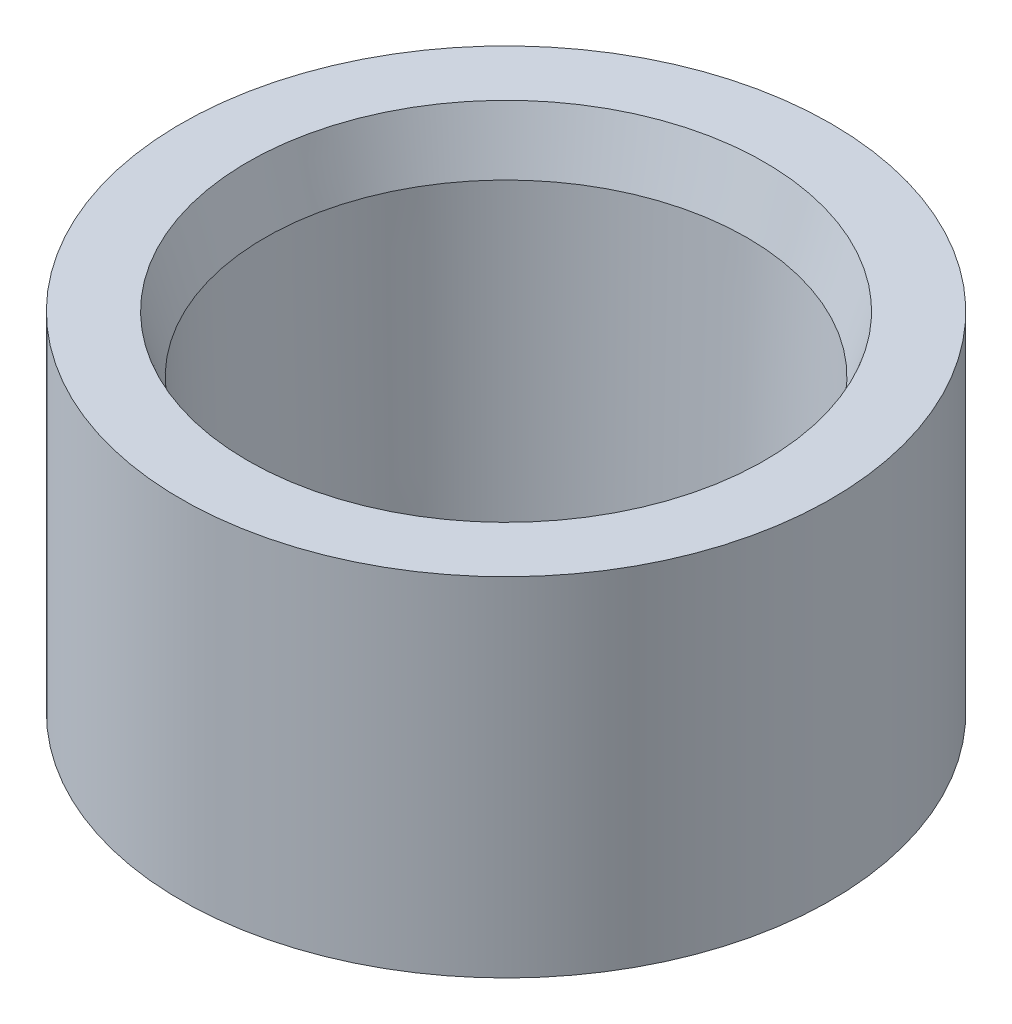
ISO-10303-21;
HEADER;
FILE_DESCRIPTION(('STEP AP214'),'2;1');
FILE_NAME('part.step','',(''),(''),'','','');
FILE_SCHEMA(('AUTOMOTIVE_DESIGN { 1 0 10303 214 1 1 1 1 }'));
ENDSEC;
DATA;
#1=APPLICATION_CONTEXT('core data for automotive mechanical design processes');
#2=APPLICATION_PROTOCOL_DEFINITION('international standard','automotive_design',2000,#1);
#3=PRODUCT_CONTEXT('',#1,'mechanical');
#4=PRODUCT('Part','Part','',(#3));
#5=PRODUCT_RELATED_PRODUCT_CATEGORY('part','',(#4));
#6=PRODUCT_DEFINITION_FORMATION('','',#4);
#7=PRODUCT_DEFINITION_CONTEXT('part definition',#1,'design');
#8=PRODUCT_DEFINITION('design','',#6,#7);
#9=PRODUCT_DEFINITION_SHAPE('','',#8);
#10=(LENGTH_UNIT() NAMED_UNIT(*) SI_UNIT(.MILLI.,.METRE.));
#11=(NAMED_UNIT(*) PLANE_ANGLE_UNIT() SI_UNIT($,.RADIAN.));
#12=(NAMED_UNIT(*) SI_UNIT($,.STERADIAN.) SOLID_ANGLE_UNIT());
#13=UNCERTAINTY_MEASURE_WITH_UNIT(LENGTH_MEASURE(1.E-05),#10,'distance_accuracy_value','');
#14=(GEOMETRIC_REPRESENTATION_CONTEXT(3) GLOBAL_UNCERTAINTY_ASSIGNED_CONTEXT((#13)) GLOBAL_UNIT_ASSIGNED_CONTEXT((#10,
#11,#12)) REPRESENTATION_CONTEXT('',''));
#15=CARTESIAN_POINT('',(0.,0.,0.));
#16=DIRECTION('',(0.,0.,1.));
#17=DIRECTION('',(1.,0.,0.));
#18=AXIS2_PLACEMENT_3D('',#15,#16,#17);
#19=CARTESIAN_POINT('',(65.4812,0.,0.));
#20=DIRECTION('',(0.,-1.,0.));
#21=DIRECTION('',(0.,0.,-1.));
#22=AXIS2_PLACEMENT_3D('',#19,#20,#21);
#23=PLANE('',#22);
#24=CARTESIAN_POINT('',(0.,0.,0.));
#25=DIRECTION('',(0.,-1.,0.));
#26=DIRECTION('',(0.,0.,-1.));
#27=AXIS2_PLACEMENT_3D('',#24,#25,#26);
#28=CIRCLE('',#27,65.4812);
#29=CARTESIAN_POINT('',(0.,0.,-65.4812));
#30=VERTEX_POINT('',#29);
#31=EDGE_CURVE('E51',#30,#30,#28,.T.);
#32=ORIENTED_EDGE('',*,*,#31,.T.);
#33=EDGE_LOOP('',(#32));
#34=FACE_BOUND('',#33,.T.);
#35=CARTESIAN_POINT('',(0.,0.,0.));
#36=DIRECTION('',(0.,-1.,0.));
#37=DIRECTION('',(0.,0.,-1.));
#38=AXIS2_PLACEMENT_3D('',#35,#36,#37);
#39=CIRCLE('',#38,46.4312);
#40=CARTESIAN_POINT('',(0.,0.,-46.4312));
#41=VERTEX_POINT('',#40);
#42=EDGE_CURVE('E60',#41,#41,#39,.T.);
#43=ORIENTED_EDGE('',*,*,#42,.F.);
#44=EDGE_LOOP('',(#43));
#45=FACE_BOUND('',#44,.T.);
#46=ADVANCED_FACE('F39',(#34,#45),#23,.T.);
#47=CARTESIAN_POINT('',(0.,0.,0.));
#48=DIRECTION('',(0.,-1.,0.));
#49=DIRECTION('',(0.,0.,-1.));
#50=AXIS2_PLACEMENT_3D('',#47,#48,#49);
#51=CYLINDRICAL_SURFACE('',#50,65.4812);
#52=CARTESIAN_POINT('',(0.,70.,0.));
#53=DIRECTION('',(0.,-1.,0.));
#54=DIRECTION('',(0.,0.,-1.));
#55=AXIS2_PLACEMENT_3D('',#52,#53,#54);
#56=CIRCLE('',#55,65.4812);
#57=CARTESIAN_POINT('',(0.,70.,-65.4812));
#58=VERTEX_POINT('',#57);
#59=EDGE_CURVE('E55',#58,#58,#56,.T.);
#60=ORIENTED_EDGE('',*,*,#59,.T.);
#61=EDGE_LOOP('',(#60));
#62=FACE_BOUND('',#61,.T.);
#63=ORIENTED_EDGE('',*,*,#31,.F.);
#64=EDGE_LOOP('',(#63));
#65=FACE_BOUND('',#64,.T.);
#66=ADVANCED_FACE('F67',(#62,#65),#51,.T.);
#67=CARTESIAN_POINT('',(48.9712,70.,0.));
#68=DIRECTION('',(0.,1.,0.));
#69=DIRECTION('',(0.,0.,1.));
#70=AXIS2_PLACEMENT_3D('',#67,#68,#69);
#71=PLANE('',#70);
#72=CARTESIAN_POINT('',(0.,70.,0.));
#73=DIRECTION('',(0.,1.,0.));
#74=DIRECTION('',(0.,0.,1.));
#75=AXIS2_PLACEMENT_3D('',#72,#73,#74);
#76=CIRCLE('',#75,52.0659643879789);
#77=CARTESIAN_POINT('',(0.,70.,52.0659643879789));
#78=VERTEX_POINT('',#77);
#79=EDGE_CURVE('E47',#78,#78,#76,.F.);
#80=ORIENTED_EDGE('',*,*,#79,.T.);
#81=EDGE_LOOP('',(#80));
#82=FACE_BOUND('',#81,.T.);
#83=ORIENTED_EDGE('',*,*,#59,.F.);
#84=EDGE_LOOP('',(#83));
#85=FACE_BOUND('',#84,.T.);
#86=ADVANCED_FACE('F72',(#82,#85),#71,.T.);
#87=CARTESIAN_POINT('',(0.,70.,0.));
#88=DIRECTION('',(0.,1.,0.));
#89=DIRECTION('',(0.,0.,1.));
#90=AXIS2_PLACEMENT_3D('',#87,#88,#89);
#91=CONICAL_SURFACE('',#90,48.9712,0.0362698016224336);
#92=CARTESIAN_POINT('',(0.,58.5775172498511,0.));
#93=DIRECTION('',(0.,-1.,0.));
#94=DIRECTION('',(0.,0.,-1.));
#95=AXIS2_PLACEMENT_3D('',#92,#93,#94);
#96=CIRCLE('',#95,48.5567270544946);
#97=CARTESIAN_POINT('',(0.,58.5775172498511,-48.5567270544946));
#98=VERTEX_POINT('',#97);
#99=EDGE_CURVE('E10',#98,#98,#96,.F.);
#100=ORIENTED_EDGE('',*,*,#99,.T.);
#101=EDGE_LOOP('',(#100));
#102=FACE_BOUND('',#101,.T.);
#103=ORIENTED_EDGE('',*,*,#42,.T.);
#104=EDGE_LOOP('',(#103));
#105=FACE_BOUND('',#104,.T.);
#106=ADVANCED_FACE('F64',(#102,#105),#91,.F.);
#107=CARTESIAN_POINT('',(0.,70.,0.));
#108=DIRECTION('',(0.,1.,0.));
#109=DIRECTION('',(0.,0.,1.));
#110=AXIS2_PLACEMENT_3D('',#107,#108,#109);
#111=CONICAL_SURFACE('',#110,52.0659643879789,0.29806918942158);
#112=ORIENTED_EDGE('',*,*,#99,.F.);
#113=EDGE_LOOP('',(#112));
#114=FACE_BOUND('',#113,.T.);
#115=ORIENTED_EDGE('',*,*,#79,.F.);
#116=EDGE_LOOP('',(#115));
#117=FACE_BOUND('',#116,.T.);
#118=ADVANCED_FACE('F42',(#114,#117),#111,.F.);
#119=CLOSED_SHELL('',(#46,#66,#86,#106,#118));
#120=MANIFOLD_SOLID_BREP('B2',#119);
#121=ADVANCED_BREP_SHAPE_REPRESENTATION('',(#18,#120),#14);
#122=SHAPE_DEFINITION_REPRESENTATION(#9,#121);
ENDSEC;
END-ISO-10303-21;
